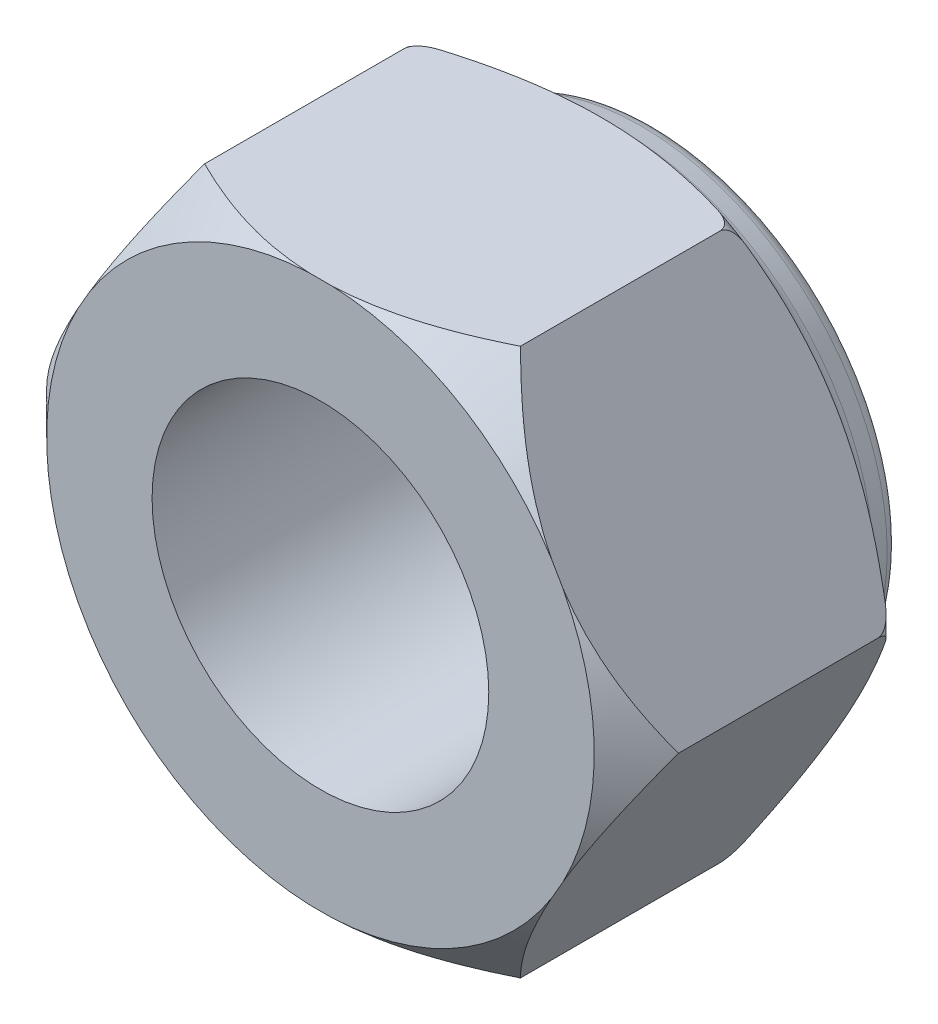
from build123d import *

# Parameters (mm, degrees)
BOSS_EXTRU_1_DEPTH      = 8
ESQUISSE2_R             = 4
ENL_V_MAT_EXTRU_1_DEPTH = 10.8


with BuildPart() as part:
    # Esquisse1 → Boss.-Extru.1 (new body)
    with BuildSketch(Plane.XY):
        Polygon((7.505553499, 0), (3.75277675, 6.5), (-3.75277675, 6.5), (-7.505553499, 0), (-3.75277675, -6.5), (3.75277675, -6.5), align=None)
    extrude(amount=BOSS_EXTRU_1_DEPTH)

    # Esquisse2 → Enl_v. mat.-Extru.1 (cut)
    with BuildSketch(Plane.XY.offset(8)):
        Circle(ESQUISSE2_R)
    extrude(amount=-ENL_V_MAT_EXTRU_1_DEPTH, mode=Mode.SUBTRACT)

    # Esquisse4 → Enl_vement de mati_re-R_volution3 (revolve, cut)
    with BuildSketch(Plane(origin=(0, 0, 0), x_dir=(1, 0, 0), z_dir=(0, 1, 0))):
        with BuildLine():
            Line((-5.9529982, -0.8119928), (-5.844683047, -0.378732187))
            ThreePointArc((-5.844683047, -0.378732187), (-5.667317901, -0.105897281), (-5.359611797, 0))
            Line((-5.359611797, 0), (-5, 0))
            Line((-5, 0), (-5, 0.779579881))
            Line((-5, 0.779579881), (-9.859228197, 0.779579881))
            Line((-9.859228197, 0.779579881), (-9.859228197, -2.985877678))
            Line((-9.859228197, -2.985877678), (-7.505553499, -2.985877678))
            Line((-7.505553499, -2.985877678), (-7.505553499, -2.268140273))
            ThreePointArc((-7.505553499, -2.268140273), (-7.44618958, -2.031835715), (-7.282194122, -1.851643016))
            Line((-7.282194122, -1.851643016), (-6.161428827, -1.107222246))
            ThreePointArc((-6.161428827, -1.107222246), (-6.029607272, -0.979097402), (-5.9529982, -0.8119928))
        make_face()
        Polygon((-9.859228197, -13.554488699), (-6.505553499, -13.554488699), (-6.505553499, -8), (-7.505553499, -7), (-9.859228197, -7), align=None)
    revolve(axis=Axis((0, 0, -0.399579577), (0, 0, 1)), mode=Mode.SUBTRACT)


solid = part.part
